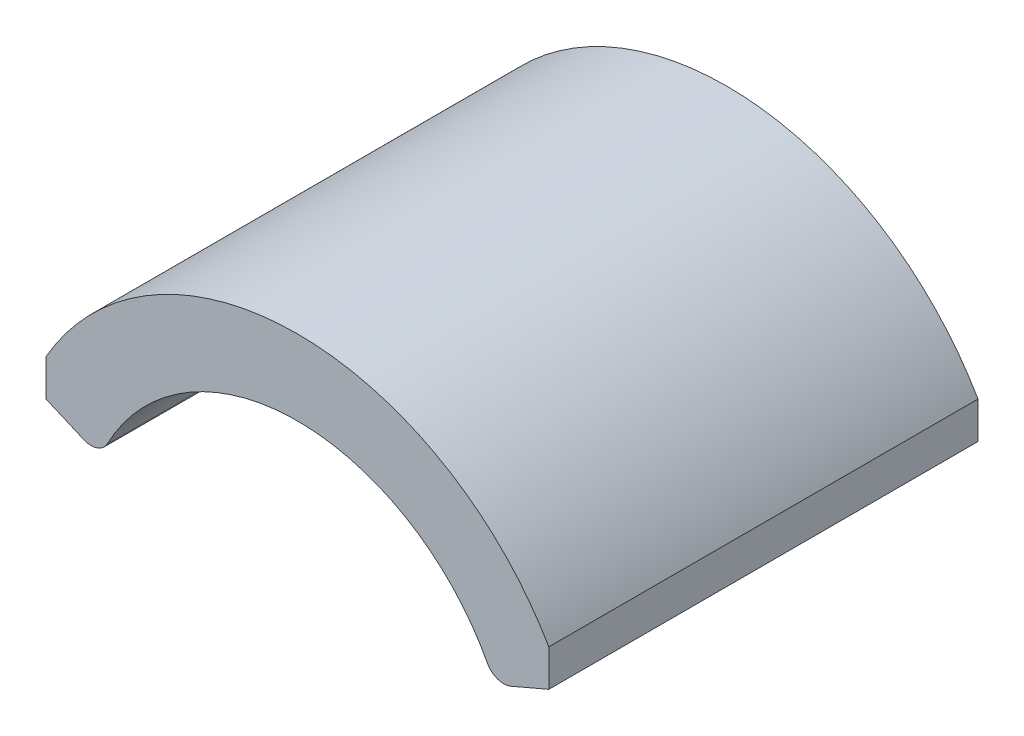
from build123d import *

# Parameters (mm, degrees)
BASE_EXTRUSION_DEPTH = 35


with BuildPart() as part:
    # Esquisse2 → Base-Extrusion (new body)
    with BuildSketch(Plane.XY.offset(-15)):
        with BuildLine():
            Line((20.5, 36.570012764), (20.5, 33.569811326))
            Line((20.5, 33.569811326), (17.407099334, 32.243228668))
            ThreePointArc((17.407099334, 32.243228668), (16.314597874, 32.20799649), (15.48825858, 32.923513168))
            ThreePointArc((15.48825858, 32.923513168), (0, 42.277112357), (-15.48825858, 32.923513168))
            ThreePointArc((-15.48825858, 32.923513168), (-16.314597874, 32.20799649), (-17.407099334, 32.243228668))
            Line((-17.407099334, 32.243228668), (-20.5, 33.569811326))
            Line((-20.5, 33.569811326), (-20.5, 36.570012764))
            ThreePointArc((-20.5, 36.570012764), (0, 48.427112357), (20.5, 36.570012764))
        make_face()
    extrude(amount=-BASE_EXTRUSION_DEPTH)


solid = part.part
